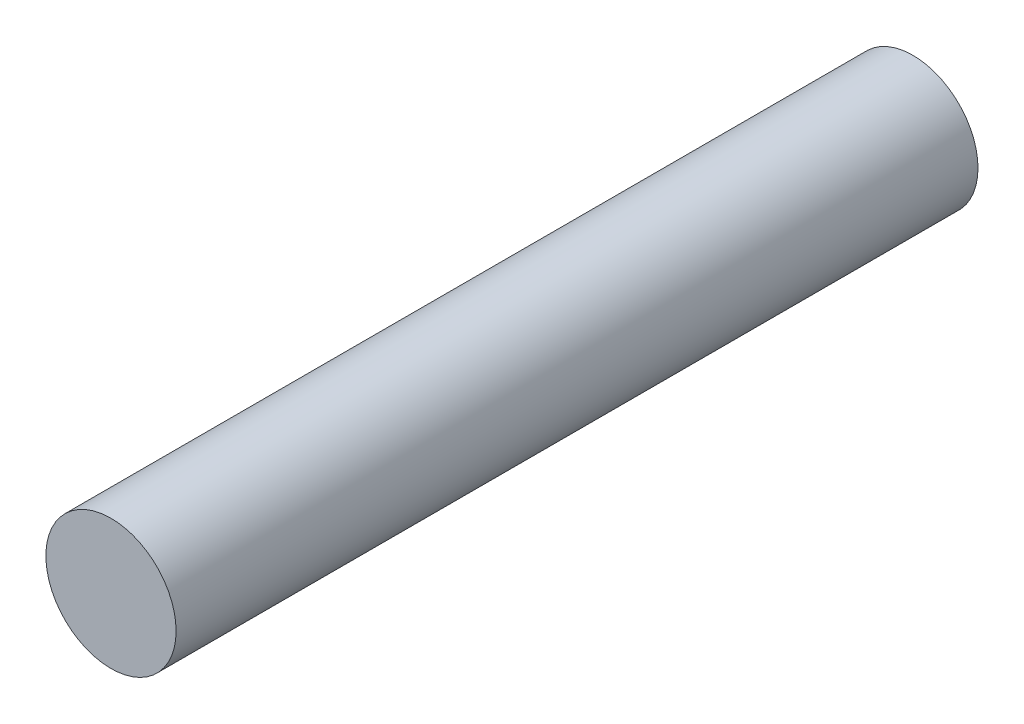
ISO-10303-21;
HEADER;
FILE_DESCRIPTION(('STEP AP214'),'2;1');
FILE_NAME('part.step','',(''),(''),'','','');
FILE_SCHEMA(('AUTOMOTIVE_DESIGN { 1 0 10303 214 1 1 1 1 }'));
ENDSEC;
DATA;
#1=APPLICATION_CONTEXT('core data for automotive mechanical design processes');
#2=APPLICATION_PROTOCOL_DEFINITION('international standard','automotive_design',2000,#1);
#3=PRODUCT_CONTEXT('',#1,'mechanical');
#4=PRODUCT('Part','Part','',(#3));
#5=PRODUCT_RELATED_PRODUCT_CATEGORY('part','',(#4));
#6=PRODUCT_DEFINITION_FORMATION('','',#4);
#7=PRODUCT_DEFINITION_CONTEXT('part definition',#1,'design');
#8=PRODUCT_DEFINITION('design','',#6,#7);
#9=PRODUCT_DEFINITION_SHAPE('','',#8);
#10=(LENGTH_UNIT() NAMED_UNIT(*) SI_UNIT(.MILLI.,.METRE.));
#11=(NAMED_UNIT(*) PLANE_ANGLE_UNIT() SI_UNIT($,.RADIAN.));
#12=(NAMED_UNIT(*) SI_UNIT($,.STERADIAN.) SOLID_ANGLE_UNIT());
#13=UNCERTAINTY_MEASURE_WITH_UNIT(LENGTH_MEASURE(1.E-05),#10,'distance_accuracy_value','');
#14=(GEOMETRIC_REPRESENTATION_CONTEXT(3) GLOBAL_UNCERTAINTY_ASSIGNED_CONTEXT((#13)) GLOBAL_UNIT_ASSIGNED_CONTEXT((#10,
#11,#12)) REPRESENTATION_CONTEXT('',''));
#15=CARTESIAN_POINT('',(0.,0.,0.));
#16=DIRECTION('',(0.,0.,1.));
#17=DIRECTION('',(1.,0.,0.));
#18=AXIS2_PLACEMENT_3D('',#15,#16,#17);
#19=CARTESIAN_POINT('',(0.,0.,46.8));
#20=DIRECTION('',(0.,0.,-1.));
#21=DIRECTION('',(-1.,0.,0.));
#22=AXIS2_PLACEMENT_3D('',#19,#20,#21);
#23=CYLINDRICAL_SURFACE('',#22,3.8);
#24=CARTESIAN_POINT('',(0.,0.,46.8));
#25=DIRECTION('',(0.,0.,1.));
#26=DIRECTION('',(1.,0.,0.));
#27=AXIS2_PLACEMENT_3D('',#24,#25,#26);
#28=CIRCLE('',#27,3.8);
#29=CARTESIAN_POINT('',(3.8,0.,46.8));
#30=VERTEX_POINT('',#29);
#31=EDGE_CURVE('E10',#30,#30,#28,.T.);
#32=ORIENTED_EDGE('',*,*,#31,.F.);
#33=EDGE_LOOP('',(#32));
#34=FACE_BOUND('',#33,.T.);
#35=CARTESIAN_POINT('',(0.,0.,0.));
#36=DIRECTION('',(0.,0.,1.));
#37=DIRECTION('',(1.,0.,0.));
#38=AXIS2_PLACEMENT_3D('',#35,#36,#37);
#39=CIRCLE('',#38,3.8);
#40=CARTESIAN_POINT('',(3.8,0.,0.));
#41=VERTEX_POINT('',#40);
#42=EDGE_CURVE('E33',#41,#41,#39,.T.);
#43=ORIENTED_EDGE('',*,*,#42,.T.);
#44=EDGE_LOOP('',(#43));
#45=FACE_BOUND('',#44,.T.);
#46=ADVANCED_FACE('F30',(#34,#45),#23,.T.);
#47=CARTESIAN_POINT('',(0.,0.,46.8));
#48=DIRECTION('',(0.,0.,1.));
#49=DIRECTION('',(1.,0.,0.));
#50=AXIS2_PLACEMENT_3D('',#47,#48,#49);
#51=PLANE('',#50);
#52=ORIENTED_EDGE('',*,*,#31,.T.);
#53=EDGE_LOOP('',(#52));
#54=FACE_BOUND('',#53,.T.);
#55=ADVANCED_FACE('F45',(#54),#51,.T.);
#56=CARTESIAN_POINT('',(0.,0.,0.));
#57=DIRECTION('',(0.,0.,1.));
#58=DIRECTION('',(1.,0.,0.));
#59=AXIS2_PLACEMENT_3D('',#56,#57,#58);
#60=PLANE('',#59);
#61=ORIENTED_EDGE('',*,*,#42,.F.);
#62=EDGE_LOOP('',(#61));
#63=FACE_BOUND('',#62,.T.);
#64=ADVANCED_FACE('F43',(#63),#60,.F.);
#65=CLOSED_SHELL('',(#46,#55,#64));
#66=MANIFOLD_SOLID_BREP('B2',#65);
#67=ADVANCED_BREP_SHAPE_REPRESENTATION('',(#18,#66),#14);
#68=SHAPE_DEFINITION_REPRESENTATION(#9,#67);
ENDSEC;
END-ISO-10303-21;
